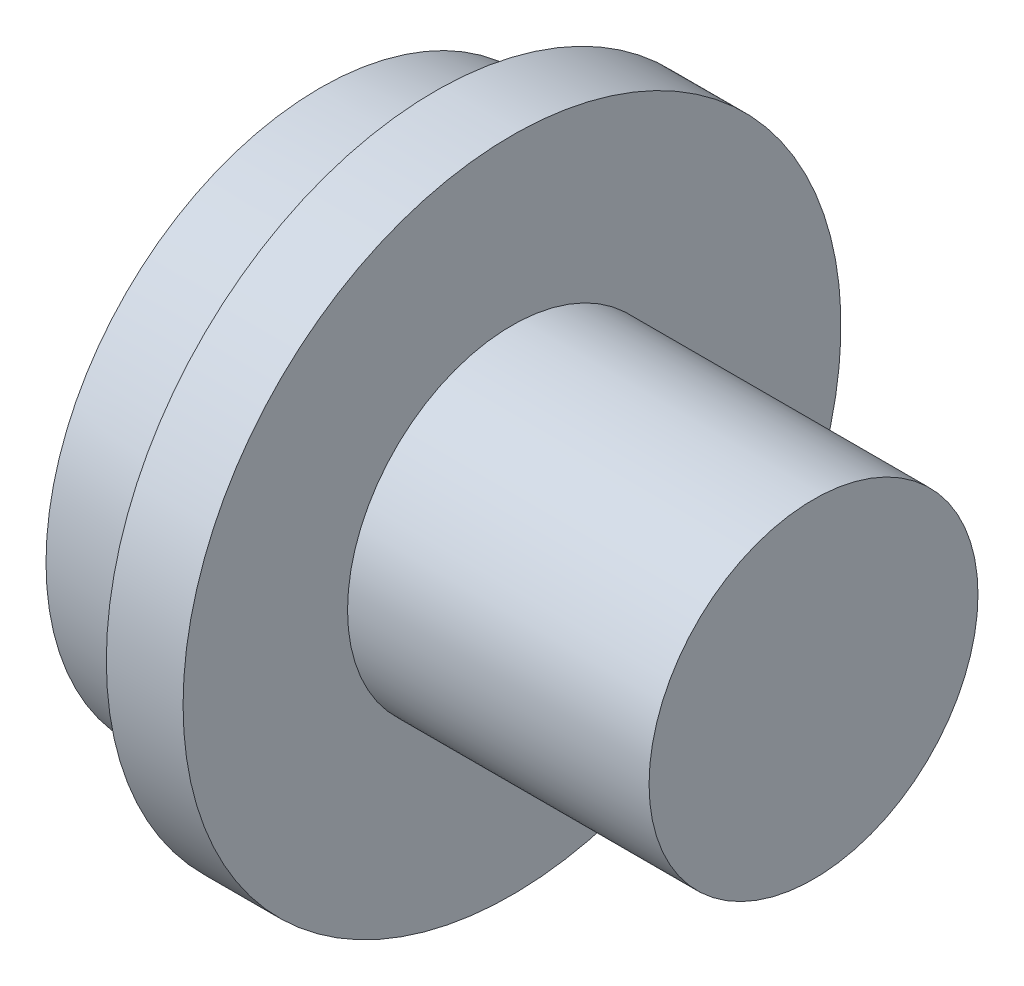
from build123d import *


with BuildPart() as part:
    # Esquisse1 → R_volution1 (revolve)
    with BuildSketch(Plane.XY, mode=Mode.PRIVATE) as r_volution1_sk:
        Polygon((-55, 60), (-55, 30), (0, 30), (0, 0), (-100, 0), (-100, 35), (-90, 35), (-90, 50), (-69, 51.578997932), (-69, 60), align=None)
    revolve(r_volution1_sk.sketch.rotate(Axis((-100, 0, 0), (1, 0, 0)), 90), axis=Axis((-100, 0, 0), (1, 0, 0)))


solid = part.part
